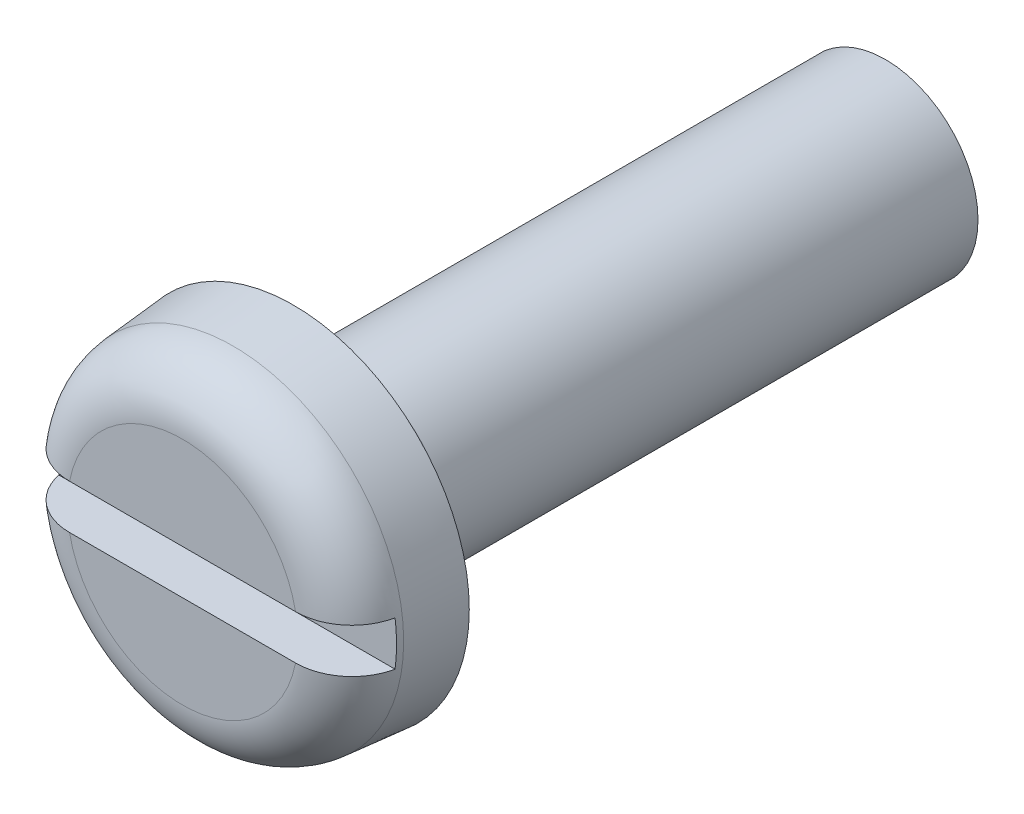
ISO-10303-21;
HEADER;
FILE_DESCRIPTION(('STEP AP214'),'2;1');
FILE_NAME('part.step','',(''),(''),'','','');
FILE_SCHEMA(('AUTOMOTIVE_DESIGN { 1 0 10303 214 1 1 1 1 }'));
ENDSEC;
DATA;
#1=APPLICATION_CONTEXT('core data for automotive mechanical design processes');
#2=APPLICATION_PROTOCOL_DEFINITION('international standard','automotive_design',2000,#1);
#3=PRODUCT_CONTEXT('',#1,'mechanical');
#4=PRODUCT('Part','Part','',(#3));
#5=PRODUCT_RELATED_PRODUCT_CATEGORY('part','',(#4));
#6=PRODUCT_DEFINITION_FORMATION('','',#4);
#7=PRODUCT_DEFINITION_CONTEXT('part definition',#1,'design');
#8=PRODUCT_DEFINITION('design','',#6,#7);
#9=PRODUCT_DEFINITION_SHAPE('','',#8);
#10=(LENGTH_UNIT() NAMED_UNIT(*) SI_UNIT(.MILLI.,.METRE.));
#11=(NAMED_UNIT(*) PLANE_ANGLE_UNIT() SI_UNIT($,.RADIAN.));
#12=(NAMED_UNIT(*) SI_UNIT($,.STERADIAN.) SOLID_ANGLE_UNIT());
#13=UNCERTAINTY_MEASURE_WITH_UNIT(LENGTH_MEASURE(1.E-05),#10,'distance_accuracy_value','');
#14=(GEOMETRIC_REPRESENTATION_CONTEXT(3) GLOBAL_UNCERTAINTY_ASSIGNED_CONTEXT((#13)) GLOBAL_UNIT_ASSIGNED_CONTEXT((#10,
#11,#12)) REPRESENTATION_CONTEXT('',''));
#15=CARTESIAN_POINT('',(0.,0.,0.));
#16=DIRECTION('',(0.,0.,1.));
#17=DIRECTION('',(1.,0.,0.));
#18=AXIS2_PLACEMENT_3D('',#15,#16,#17);
#19=CARTESIAN_POINT('',(0.,0.,-0.2));
#20=DIRECTION('',(0.,0.,1.));
#21=DIRECTION('',(1.,0.,0.));
#22=AXIS2_PLACEMENT_3D('',#19,#20,#21);
#23=TOROIDAL_SURFACE('',#22,2.5,0.2);
#24=CARTESIAN_POINT('',(0.,0.,0.));
#25=DIRECTION('',(0.,0.,1.));
#26=DIRECTION('',(1.,0.,0.));
#27=AXIS2_PLACEMENT_3D('',#24,#25,#26);
#28=CIRCLE('',#27,2.5);
#29=CARTESIAN_POINT('',(2.5,0.,0.));
#30=VERTEX_POINT('',#29);
#31=EDGE_CURVE('E117',#30,#30,#28,.T.);
#32=ORIENTED_EDGE('',*,*,#31,.F.);
#33=EDGE_LOOP('',(#32));
#34=FACE_BOUND('',#33,.T.);
#35=CARTESIAN_POINT('',(0.,0.,-0.228571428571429));
#36=DIRECTION('',(0.,0.,1.));
#37=DIRECTION('',(1.,0.,0.));
#38=AXIS2_PLACEMENT_3D('',#35,#36,#37);
#39=CIRCLE('',#38,2.30205133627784);
#40=CARTESIAN_POINT('',(2.30205133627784,0.,-0.228571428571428));
#41=VERTEX_POINT('',#40);
#42=EDGE_CURVE('E11',#41,#41,#39,.T.);
#43=ORIENTED_EDGE('',*,*,#42,.T.);
#44=EDGE_LOOP('',(#43));
#45=FACE_BOUND('',#44,.T.);
#46=ADVANCED_FACE('F34',(#34,#45),#23,.F.);
#47=CARTESIAN_POINT('',(0.,0.,-1.6));
#48=DIRECTION('',(0.,0.,-1.));
#49=DIRECTION('',(-1.,0.,0.));
#50=AXIS2_PLACEMENT_3D('',#47,#48,#49);
#51=CONICAL_SURFACE('',#50,2.5,0.143347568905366);
#52=ORIENTED_EDGE('',*,*,#42,.F.);
#53=EDGE_LOOP('',(#52));
#54=FACE_BOUND('',#53,.T.);
#55=CARTESIAN_POINT('',(0.,0.,-1.6));
#56=DIRECTION('',(0.,0.,1.));
#57=DIRECTION('',(1.,0.,0.));
#58=AXIS2_PLACEMENT_3D('',#55,#56,#57);
#59=CIRCLE('',#58,2.5);
#60=CARTESIAN_POINT('',(2.5,0.,-1.6));
#61=VERTEX_POINT('',#60);
#62=EDGE_CURVE('E42',#61,#61,#59,.T.);
#63=ORIENTED_EDGE('',*,*,#62,.T.);
#64=EDGE_LOOP('',(#63));
#65=FACE_BOUND('',#64,.T.);
#66=ADVANCED_FACE('F170',(#54,#65),#51,.T.);
#67=CARTESIAN_POINT('',(0.,0.,0.));
#68=DIRECTION('',(0.,0.,1.));
#69=DIRECTION('',(1.,0.,0.));
#70=AXIS2_PLACEMENT_3D('',#67,#68,#69);
#71=CYLINDRICAL_SURFACE('',#70,2.5);
#72=ORIENTED_EDGE('',*,*,#62,.F.);
#73=EDGE_LOOP('',(#72));
#74=FACE_BOUND('',#73,.T.);
#75=CARTESIAN_POINT('',(0.,0.,-16.));
#76=DIRECTION('',(0.,0.,-1.));
#77=DIRECTION('',(-1.,0.,0.));
#78=AXIS2_PLACEMENT_3D('',#75,#76,#77);
#79=CIRCLE('',#78,2.5);
#80=CARTESIAN_POINT('',(-2.5,0.,-16.));
#81=VERTEX_POINT('',#80);
#82=EDGE_CURVE('E161',#81,#81,#79,.T.);
#83=ORIENTED_EDGE('',*,*,#82,.F.);
#84=EDGE_LOOP('',(#83));
#85=FACE_BOUND('',#84,.T.);
#86=ADVANCED_FACE('F167',(#74,#85),#71,.T.);
#87=CARTESIAN_POINT('',(0.,-4.75,0.));
#88=DIRECTION('',(0.,0.,-1.));
#89=DIRECTION('',(-1.,0.,0.));
#90=AXIS2_PLACEMENT_3D('',#87,#88,#89);
#91=PLANE('',#90);
#92=CARTESIAN_POINT('',(0.,0.,0.));
#93=DIRECTION('',(0.,0.,1.));
#94=DIRECTION('',(1.,0.,0.));
#95=AXIS2_PLACEMENT_3D('',#92,#93,#94);
#96=CIRCLE('',#95,4.75);
#97=CARTESIAN_POINT('',(4.75,0.,0.));
#98=VERTEX_POINT('',#97);
#99=EDGE_CURVE('E144',#98,#98,#96,.T.);
#100=ORIENTED_EDGE('',*,*,#99,.F.);
#101=EDGE_LOOP('',(#100));
#102=FACE_BOUND('',#101,.T.);
#103=ORIENTED_EDGE('',*,*,#31,.T.);
#104=EDGE_LOOP('',(#103));
#105=FACE_BOUND('',#104,.T.);
#106=ADVANCED_FACE('F169',(#102,#105),#91,.T.);
#107=CARTESIAN_POINT('',(0.,-3.11303724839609,3.));
#108=DIRECTION('',(0.,0.,-1.));
#109=DIRECTION('',(-1.,0.,0.));
#110=AXIS2_PLACEMENT_3D('',#107,#108,#109);
#111=PLANE('',#110);
#112=CARTESIAN_POINT('',(0.,0.,3.));
#113=DIRECTION('',(0.,0.,1.));
#114=DIRECTION('',(1.,0.,0.));
#115=AXIS2_PLACEMENT_3D('',#112,#113,#114);
#116=CIRCLE('',#115,3.11303724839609);
#117=CARTESIAN_POINT('',(-3.05466870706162,-0.6,3.));
#118=VERTEX_POINT('',#117);
#119=CARTESIAN_POINT('',(3.05466870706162,-0.6,3.));
#120=VERTEX_POINT('',#119);
#121=EDGE_CURVE('E150',#118,#120,#116,.T.);
#122=ORIENTED_EDGE('',*,*,#121,.T.);
#123=DIRECTION('',(1.,0.,0.));
#124=VECTOR('',#123,1.);
#125=CARTESIAN_POINT('',(-4.75,-0.6,3.));
#126=LINE('',#125,#124);
#127=EDGE_CURVE('E65',#118,#120,#126,.T.);
#128=ORIENTED_EDGE('',*,*,#127,.F.);
#129=EDGE_LOOP('',(#122,#128));
#130=FACE_BOUND('',#129,.T.);
#131=ADVANCED_FACE('F177',(#130),#111,.F.);
#132=CARTESIAN_POINT('',(0.,0.,0.));
#133=DIRECTION('',(0.,0.,-1.));
#134=DIRECTION('',(-1.,0.,0.));
#135=AXIS2_PLACEMENT_3D('',#132,#133,#134);
#136=CONICAL_SURFACE('',#135,4.75,0.0872664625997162);
#137=CARTESIAN_POINT('',(0.,0.,1.63073361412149));
#138=DIRECTION('',(0.,0.,1.));
#139=DIRECTION('',(1.,0.,0.));
#140=AXIS2_PLACEMENT_3D('',#137,#138,#139);
#141=CIRCLE('',#140,4.60732929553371);
#142=CARTESIAN_POINT('',(4.60732929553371,0.,1.63073361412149));
#143=VERTEX_POINT('',#142);
#144=EDGE_CURVE('E151',#143,#143,#141,.T.);
#145=ORIENTED_EDGE('',*,*,#144,.F.);
#146=EDGE_LOOP('',(#145));
#147=FACE_BOUND('',#146,.T.);
#148=ORIENTED_EDGE('',*,*,#99,.T.);
#149=EDGE_LOOP('',(#148));
#150=FACE_BOUND('',#149,.T.);
#151=ADVANCED_FACE('F225',(#147,#150),#136,.T.);
#152=CARTESIAN_POINT('',(3.05466870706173,0.6,3.));
#153=VERTEX_POINT('',#152);
#154=CARTESIAN_POINT('',(-3.05466870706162,0.6,3.));
#155=VERTEX_POINT('',#154);
#156=EDGE_CURVE('E110',#153,#155,#116,.T.);
#157=ORIENTED_EDGE('',*,*,#156,.T.);
#158=DIRECTION('',(1.,0.,0.));
#159=VECTOR('',#158,1.);
#160=CARTESIAN_POINT('',(-4.75,0.6,3.));
#161=LINE('',#160,#159);
#162=EDGE_CURVE('E104',#155,#153,#161,.T.);
#163=ORIENTED_EDGE('',*,*,#162,.T.);
#164=EDGE_LOOP('',(#157,#163));
#165=FACE_BOUND('',#164,.T.);
#166=ADVANCED_FACE('F227',(#165),#111,.F.);
#167=CARTESIAN_POINT('',(0.,0.,1.5));
#168=DIRECTION('',(0.,0.,1.));
#169=DIRECTION('',(1.,0.,0.));
#170=AXIS2_PLACEMENT_3D('',#167,#168,#169);
#171=TOROIDAL_SURFACE('',#170,3.11303724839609,1.5);
#172=CARTESIAN_POINT('',(1.78444467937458,-0.6,2.35794138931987));
#173=CARTESIAN_POINT('',(1.83690352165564,-0.6,2.42924707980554));
#174=CARTESIAN_POINT('',(1.8955755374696,-0.6,2.49608392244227));
#175=CARTESIAN_POINT('',(2.02337981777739,-0.6,2.61902622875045));
#176=CARTESIAN_POINT('',(2.09253096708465,-0.6,2.67511189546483));
#177=CARTESIAN_POINT('',(2.23912059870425,-0.6,2.77492489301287));
#178=CARTESIAN_POINT('',(2.31654826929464,-0.6,2.81866808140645));
#179=CARTESIAN_POINT('',(2.47756798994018,-0.6,2.89264178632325));
#180=CARTESIAN_POINT('',(2.56115732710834,-0.6,2.92287820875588));
#181=CARTESIAN_POINT('',(2.73293900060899,-0.6,2.96912896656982));
#182=CARTESIAN_POINT('',(2.82116384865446,-0.6,2.98502287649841));
#183=CARTESIAN_POINT('',(2.99904386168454,-0.6,3.00155670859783));
#184=CARTESIAN_POINT('',(3.08869907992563,-0.6,3.00219606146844));
#185=CARTESIAN_POINT('',(3.26558059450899,-0.6,2.98814682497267));
#186=CARTESIAN_POINT('',(3.35282334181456,-0.6,2.97366589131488));
#187=CARTESIAN_POINT('',(3.52354291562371,-0.6,2.92998057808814));
#188=CARTESIAN_POINT('',(3.60702014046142,-0.6,2.90077775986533));
#189=CARTESIAN_POINT('',(3.76619303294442,-0.6,2.82907393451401));
#190=CARTESIAN_POINT('',(3.8420041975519,-0.6,2.78682927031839));
#191=CARTESIAN_POINT('',(3.98530836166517,-0.6,2.69002408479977));
#192=CARTESIAN_POINT('',(4.05280208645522,-0.6,2.63546463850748));
#193=CARTESIAN_POINT('',(4.17647632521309,-0.6,2.51649131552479));
#194=CARTESIAN_POINT('',(4.23281374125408,-0.6,2.45224049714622));
#195=CARTESIAN_POINT('',(4.33376627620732,-0.6,2.31510841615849));
#196=CARTESIAN_POINT('',(4.37838209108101,-0.6,2.24222766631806));
#197=CARTESIAN_POINT('',(4.4541578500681,-0.6,2.09072248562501));
#198=CARTESIAN_POINT('',(4.4854521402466,-0.6,2.01216522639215));
#199=CARTESIAN_POINT('',(4.53432193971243,-0.6,1.85089373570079));
#200=CARTESIAN_POINT('',(4.55189796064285,-0.6,1.7681796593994));
#201=CARTESIAN_POINT('',(4.57274942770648,-0.6,1.60145125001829));
#202=CARTESIAN_POINT('',(4.57610622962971,-0.6,1.51744708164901));
#203=CARTESIAN_POINT('',(4.56864397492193,-0.6,1.35007159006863));
#204=CARTESIAN_POINT('',(4.55782514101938,-0.6,1.26670025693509));
#205=CARTESIAN_POINT('',(4.52235909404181,-0.6,1.10309443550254));
#206=CARTESIAN_POINT('',(4.49773409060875,-0.6,1.02285512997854));
#207=CARTESIAN_POINT('',(4.43539277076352,-0.6,0.867636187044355));
#208=CARTESIAN_POINT('',(4.39767641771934,-0.6,0.79265656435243));
#209=CARTESIAN_POINT('',(4.31014761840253,-0.6,0.649886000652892));
#210=CARTESIAN_POINT('',(4.26030712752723,-0.6,0.58211225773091));
#211=CARTESIAN_POINT('',(4.15002218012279,-0.6,0.455828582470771));
#212=CARTESIAN_POINT('',(4.0895774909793,-0.6,0.397318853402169));
#213=CARTESIAN_POINT('',(3.95939810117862,-0.6,0.290802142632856));
#214=CARTESIAN_POINT('',(3.88960598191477,-0.6,0.242865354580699));
#215=CARTESIAN_POINT('',(3.7430351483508,-0.6,0.15924465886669));
#216=CARTESIAN_POINT('',(3.66625613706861,-0.6,0.123561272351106));
#217=CARTESIAN_POINT('',(3.5069992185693,-0.6,0.0650186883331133));
#218=CARTESIAN_POINT('',(3.42446799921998,-0.6,0.0423045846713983));
#219=CARTESIAN_POINT('',(3.25679047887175,-0.6,0.0108239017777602));
#220=CARTESIAN_POINT('',(3.17164399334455,-0.6,0.00205830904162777));
#221=CARTESIAN_POINT('',(2.99973325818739,-0.6,-0.00144063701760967));
#222=CARTESIAN_POINT('',(2.9129645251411,-0.6,0.00404749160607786));
#223=CARTESIAN_POINT('',(2.74151789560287,-0.6,0.0292395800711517));
#224=CARTESIAN_POINT('',(2.65684020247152,-0.6,0.0489449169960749));
#225=CARTESIAN_POINT('',(2.49032583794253,-0.6,0.10241437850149));
#226=CARTESIAN_POINT('',(2.40856994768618,-0.6,0.136430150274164));
#227=CARTESIAN_POINT('',(2.25181146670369,-0.6,0.217532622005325));
#228=CARTESIAN_POINT('',(2.17680984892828,-0.6,0.264621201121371));
#229=CARTESIAN_POINT('',(2.03476656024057,-0.6,0.371261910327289));
#230=CARTESIAN_POINT('',(1.9678365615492,-0.6,0.430962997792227));
#231=CARTESIAN_POINT('',(1.84509773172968,-0.6,0.560904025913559));
#232=CARTESIAN_POINT('',(1.78928972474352,-0.6,0.631144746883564));
#233=CARTESIAN_POINT('',(1.69151599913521,-0.6,0.779227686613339));
#234=CARTESIAN_POINT('',(1.64935982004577,-0.6,0.856943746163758));
#235=CARTESIAN_POINT('',(1.57962775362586,-0.6,1.01865372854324));
#236=CARTESIAN_POINT('',(1.55204276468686,-0.6,1.10264369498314));
#237=CARTESIAN_POINT('',(1.51405337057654,-0.6,1.26925299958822));
#238=CARTESIAN_POINT('',(1.50273689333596,-0.6,1.35166422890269));
#239=CARTESIAN_POINT('',(1.49493998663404,-0.6,1.51719840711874));
#240=CARTESIAN_POINT('',(1.49845862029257,-0.6,1.60032131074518));
#241=CARTESIAN_POINT('',(1.5195684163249,-0.6,1.76045042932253));
#242=CARTESIAN_POINT('',(1.53644040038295,-0.6,1.83755362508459));
#243=CARTESIAN_POINT('',(1.58254863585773,-0.6,1.98789309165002));
#244=CARTESIAN_POINT('',(1.61177190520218,-0.6,2.06113333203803));
#245=CARTESIAN_POINT('',(1.6661558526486,-0.6,2.17122521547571));
#246=CARTESIAN_POINT('',(1.68752043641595,-0.6,2.21000400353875));
#247=CARTESIAN_POINT('',(1.73355428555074,-0.6,2.28554106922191));
#248=CARTESIAN_POINT('',(1.75822331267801,-0.6,2.32229949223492));
#249=CARTESIAN_POINT('',(1.78444467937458,-0.6,2.35794138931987));
#250=B_SPLINE_CURVE_WITH_KNOTS('',3,(#172,#173,#174,#175,#176,#177,#178,#179,#180,#181,#182,
#183,#184,#185,#186,#187,#188,#189,#190,#191,#192,#193,#194,#195,#196,#197,#198,#199,#200,#201,
#202,#203,#204,#205,#206,#207,#208,#209,#210,#211,#212,#213,#214,#215,#216,#217,#218,#219,#220,
#221,#222,#223,#224,#225,#226,#227,#228,#229,#230,#231,#232,#233,#234,#235,#236,#237,#238,#239,
#240,#241,#242,#243,#244,#245,#246,#247,#248,#249),.UNSPECIFIED.,.T.,.F.,(4,2,2,2,2,2,2,2,2,2,2,
2,2,2,2,2,2,2,2,2,2,2,2,2,2,2,2,2,2,2,2,2,2,2,2,2,2,2,4),(0.,0.26540428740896,0.531292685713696,
0.796837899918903,1.06226688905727,1.329904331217,1.59755176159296,1.86157117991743,
2.12556260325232,2.3846640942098,2.64374297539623,2.89886888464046,3.15397964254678,
3.40645291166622,3.65891676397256,3.90993416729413,4.16094762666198,4.41155844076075,
4.66216995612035,4.9133667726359,5.16456910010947,5.41739205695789,5.67022576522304,
5.92583525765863,6.18146282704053,6.44108615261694,6.70073462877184,6.96515356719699,
7.22961053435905,7.49738541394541,7.76518012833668,8.02905935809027,8.29277356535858,
8.54103382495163,8.78927840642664,9.02499451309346,9.26046347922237,9.39313443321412,
9.52579582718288),.UNSPECIFIED.);
#251=CARTESIAN_POINT('',(4.54328342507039,-0.6,1.8));
#252=VERTEX_POINT('',#251);
#253=EDGE_CURVE('E112',#120,#252,#250,.T.);
#254=ORIENTED_EDGE('',*,*,#253,.F.);
#255=ORIENTED_EDGE('',*,*,#121,.F.);
#256=CARTESIAN_POINT('',(-4.16448807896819,-0.6,2.52575634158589));
#257=CARTESIAN_POINT('',(-4.10593108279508,-0.6,2.58759040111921));
#258=CARTESIAN_POINT('',(-4.04205754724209,-0.6,2.64448315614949));
#259=CARTESIAN_POINT('',(-3.90557965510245,-0.6,2.74673868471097));
#260=CARTESIAN_POINT('',(-3.8329636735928,-0.6,2.79208585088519));
#261=CARTESIAN_POINT('',(-3.6812385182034,-0.6,2.86993634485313));
#262=CARTESIAN_POINT('',(-3.60213624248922,-0.6,2.90245310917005));
#263=CARTESIAN_POINT('',(-3.43965944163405,-0.6,2.95388684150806));
#264=CARTESIAN_POINT('',(-3.35628600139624,-0.6,2.97280724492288));
#265=CARTESIAN_POINT('',(-3.18666752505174,-0.6,2.99679128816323));
#266=CARTESIAN_POINT('',(-3.10040138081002,-0.6,3.00170544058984));
#267=CARTESIAN_POINT('',(-2.92823768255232,-0.6,2.99724984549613));
#268=CARTESIAN_POINT('',(-2.84234017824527,-0.6,2.98787822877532));
#269=CARTESIAN_POINT('',(-2.67171740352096,-0.6,2.95493830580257));
#270=CARTESIAN_POINT('',(-2.58704058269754,-0.6,2.93111906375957));
#271=CARTESIAN_POINT('',(-2.4227747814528,-0.6,2.86983644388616));
#272=CARTESIAN_POINT('',(-2.34318639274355,-0.6,2.83237148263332));
#273=CARTESIAN_POINT('',(-2.19000637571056,-0.6,2.74414265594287));
#274=CARTESIAN_POINT('',(-2.11653425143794,-0.6,2.69317111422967));
#275=CARTESIAN_POINT('',(-1.97917572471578,-0.6,2.57960096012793));
#276=CARTESIAN_POINT('',(-1.9152908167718,-0.6,2.51700053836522));
#277=CARTESIAN_POINT('',(-1.79922493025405,-0.6,2.38190312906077));
#278=CARTESIAN_POINT('',(-1.74702578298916,-0.6,2.30942179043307));
#279=CARTESIAN_POINT('',(-1.65617143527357,-0.6,2.15640604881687));
#280=CARTESIAN_POINT('',(-1.61751169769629,-0.6,2.07587435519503));
#281=CARTESIAN_POINT('',(-1.55688948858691,-0.6,1.91273839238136));
#282=CARTESIAN_POINT('',(-1.53427068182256,-0.6,1.83037882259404));
#283=CARTESIAN_POINT('',(-1.50426955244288,-0.6,1.66294547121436));
#284=CARTESIAN_POINT('',(-1.49687837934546,-0.6,1.57787329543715));
#285=CARTESIAN_POINT('',(-1.4977182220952,-0.6,1.41331484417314));
#286=CARTESIAN_POINT('',(-1.50497326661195,-0.6,1.33382186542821));
#287=CARTESIAN_POINT('',(-1.53279061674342,-0.6,1.17720481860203));
#288=CARTESIAN_POINT('',(-1.55335401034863,-0.6,1.10008094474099));
#289=CARTESIAN_POINT('',(-1.60674103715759,-0.6,0.950510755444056));
#290=CARTESIAN_POINT('',(-1.63952477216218,-0.6,0.878050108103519));
#291=CARTESIAN_POINT('',(-1.7161028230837,-0.6,0.739209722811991));
#292=CARTESIAN_POINT('',(-1.75989979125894,-0.6,0.672831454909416));
#293=CARTESIAN_POINT('',(-1.86010993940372,-0.6,0.54375216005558));
#294=CARTESIAN_POINT('',(-1.91712921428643,-0.6,0.48152158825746));
#295=CARTESIAN_POINT('',(-2.04035161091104,-0.6,0.366934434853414));
#296=CARTESIAN_POINT('',(-2.10655695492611,-0.6,0.314580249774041));
#297=CARTESIAN_POINT('',(-2.24995520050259,-0.6,0.218621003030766));
#298=CARTESIAN_POINT('',(-2.32753422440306,-0.6,0.175591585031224));
#299=CARTESIAN_POINT('',(-2.48876491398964,-0.6,0.103010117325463));
#300=CARTESIAN_POINT('',(-2.57241708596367,-0.6,0.0734591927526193));
#301=CARTESIAN_POINT('',(-2.74436421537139,-0.6,0.0285216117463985));
#302=CARTESIAN_POINT('',(-2.83269773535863,-0.6,0.0132820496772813));
#303=CARTESIAN_POINT('',(-3.0106737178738,-0.6,-0.00192802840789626));
#304=CARTESIAN_POINT('',(-3.10031610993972,-0.6,-0.00189936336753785));
#305=CARTESIAN_POINT('',(-3.27703669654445,-0.6,0.0134667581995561));
#306=CARTESIAN_POINT('',(-3.36413320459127,-0.6,0.0285931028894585));
#307=CARTESIAN_POINT('',(-3.53445278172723,-0.6,0.0735345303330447));
#308=CARTESIAN_POINT('',(-3.61767622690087,-0.6,0.103348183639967));
#309=CARTESIAN_POINT('',(-3.7762470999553,-0.6,0.176209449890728));
#310=CARTESIAN_POINT('',(-3.8517117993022,-0.6,0.219001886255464));
#311=CARTESIAN_POINT('',(-3.99423591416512,-0.6,0.316834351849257));
#312=CARTESIAN_POINT('',(-4.06129603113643,-0.6,0.371873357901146));
#313=CARTESIAN_POINT('',(-4.18404243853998,-0.6,0.491722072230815));
#314=CARTESIAN_POINT('',(-4.23988572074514,-0.6,0.556371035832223));
#315=CARTESIAN_POINT('',(-4.33979100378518,-0.6,0.694208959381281));
#316=CARTESIAN_POINT('',(-4.38385368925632,-0.6,0.767397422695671));
#317=CARTESIAN_POINT('',(-4.45849174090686,-0.6,0.919425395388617));
#318=CARTESIAN_POINT('',(-4.48920025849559,-0.6,0.998199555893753));
#319=CARTESIAN_POINT('',(-4.53687031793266,-0.6,1.159799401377));
#320=CARTESIAN_POINT('',(-4.55383292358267,-0.6,1.24262477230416));
#321=CARTESIAN_POINT('',(-4.57345374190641,-0.6,1.40946823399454));
#322=CARTESIAN_POINT('',(-4.5761935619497,-0.6,1.49347674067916));
#323=CARTESIAN_POINT('',(-4.56750581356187,-0.6,1.66078113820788));
#324=CARTESIAN_POINT('',(-4.55607478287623,-0.6,1.74407684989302));
#325=CARTESIAN_POINT('',(-4.51940184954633,-0.6,1.90747064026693));
#326=CARTESIAN_POINT('',(-4.49417405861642,-0.6,1.98757189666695));
#327=CARTESIAN_POINT('',(-4.43067007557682,-0.6,2.14234114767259));
#328=CARTESIAN_POINT('',(-4.39241024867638,-0.6,2.21701581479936));
#329=CARTESIAN_POINT('',(-4.32168602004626,-0.6,2.33052120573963));
#330=CARTESIAN_POINT('',(-4.29300657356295,-0.6,2.37175930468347));
#331=CARTESIAN_POINT('',(-4.23166298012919,-0.6,2.45115580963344));
#332=CARTESIAN_POINT('',(-4.1989988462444,-0.6,2.48931422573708));
#333=CARTESIAN_POINT('',(-4.16448807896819,-0.6,2.52575634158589));
#334=B_SPLINE_CURVE_WITH_KNOTS('',3,(#256,#257,#258,#259,#260,#261,#262,#263,#264,#265,#266,
#267,#268,#269,#270,#271,#272,#273,#274,#275,#276,#277,#278,#279,#280,#281,#282,#283,#284,#285,
#286,#287,#288,#289,#290,#291,#292,#293,#294,#295,#296,#297,#298,#299,#300,#301,#302,#303,#304,
#305,#306,#307,#308,#309,#310,#311,#312,#313,#314,#315,#316,#317,#318,#319,#320,#321,#322,#323,
#324,#325,#326,#327,#328,#329,#330,#331,#332,#333),.UNSPECIFIED.,.T.,.F.,(4,2,2,2,2,2,2,2,2,2,2,
2,2,2,2,2,2,2,2,2,2,2,2,2,2,2,2,2,2,2,2,2,2,2,2,2,2,2,4),(0.,0.255296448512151,
0.510936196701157,0.76630751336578,1.02161428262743,1.27963589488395,1.5376912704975,
1.8003624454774,2.06306411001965,2.33006648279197,2.59711043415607,2.8637362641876,
3.13027266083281,3.38515155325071,3.63988226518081,3.87819866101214,4.11653454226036,
4.35409900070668,4.59172072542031,4.84382021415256,5.09598079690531,5.36088081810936,
5.62580294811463,5.89341910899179,6.16102091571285,6.42493252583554,6.68881845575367,
6.94781983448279,7.20679958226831,7.46185384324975,7.71689327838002,7.96932796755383,
8.22174311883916,8.47270835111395,8.72373491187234,8.97450519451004,9.22496172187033,
9.37542205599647,9.52588189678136),.UNSPECIFIED.);
#335=CARTESIAN_POINT('',(-4.54328342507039,-0.6,1.8));
#336=VERTEX_POINT('',#335);
#337=EDGE_CURVE('E94',#336,#118,#334,.T.);
#338=ORIENTED_EDGE('',*,*,#337,.F.);
#339=CARTESIAN_POINT('',(0.,0.,1.8));
#340=DIRECTION('',(0.,0.,-1.));
#341=DIRECTION('',(-1.,0.,0.));
#342=AXIS2_PLACEMENT_3D('',#339,#340,#341);
#343=CIRCLE('',#342,4.582731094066);
#344=CARTESIAN_POINT('',(-4.54328342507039,0.6,1.8));
#345=VERTEX_POINT('',#344);
#346=EDGE_CURVE('E96',#345,#336,#343,.F.);
#347=ORIENTED_EDGE('',*,*,#346,.F.);
#348=CARTESIAN_POINT('',(-4.16448807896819,0.6,2.52575634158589));
#349=CARTESIAN_POINT('',(-4.2222007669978,0.6,2.46480270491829));
#350=CARTESIAN_POINT('',(-4.27483380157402,0.6,2.3989590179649));
#351=CARTESIAN_POINT('',(-4.36835495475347,0.6,2.25932438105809));
#352=CARTESIAN_POINT('',(-4.40922990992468,0.6,2.18552465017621));
#353=CARTESIAN_POINT('',(-4.47797693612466,0.6,2.0321094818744));
#354=CARTESIAN_POINT('',(-4.50585200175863,0.6,1.95249538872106));
#355=CARTESIAN_POINT('',(-4.54777716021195,0.6,1.78972713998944));
#356=CARTESIAN_POINT('',(-4.56183052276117,0.6,1.70657382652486));
#357=CARTESIAN_POINT('',(-4.57568541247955,0.6,1.53938213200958));
#358=CARTESIAN_POINT('',(-4.57553672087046,0.6,1.45534787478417));
#359=CARTESIAN_POINT('',(-4.56111544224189,0.6,1.28849842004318));
#360=CARTESIAN_POINT('',(-4.54684255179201,0.6,1.20568324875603));
#361=CARTESIAN_POINT('',(-4.5046163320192,0.6,1.04371892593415));
#362=CARTESIAN_POINT('',(-4.47667847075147,0.6,0.964565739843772));
#363=CARTESIAN_POINT('',(-4.40794662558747,0.6,0.812055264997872));
#364=CARTESIAN_POINT('',(-4.3671525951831,0.6,0.738697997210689));
#365=CARTESIAN_POINT('',(-4.27376142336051,0.6,0.599626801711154));
#366=CARTESIAN_POINT('',(-4.2211312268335,0.6,0.533935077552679));
#367=CARTESIAN_POINT('',(-4.10565865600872,0.6,0.412245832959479));
#368=CARTESIAN_POINT('',(-4.04281605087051,0.6,0.356248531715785));
#369=CARTESIAN_POINT('',(-3.90824759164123,0.6,0.255100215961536));
#370=CARTESIAN_POINT('',(-3.83646274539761,0.6,0.210027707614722));
#371=CARTESIAN_POINT('',(-3.68641296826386,0.6,0.132418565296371));
#372=CARTESIAN_POINT('',(-3.60814773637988,0.6,0.0998825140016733));
#373=CARTESIAN_POINT('',(-3.44640006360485,0.6,0.0478448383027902));
#374=CARTESIAN_POINT('',(-3.36286776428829,0.6,0.0284982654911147));
#375=CARTESIAN_POINT('',(-3.19375865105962,0.6,0.00386379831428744));
#376=CARTESIAN_POINT('',(-3.10818168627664,0.6,-0.00142305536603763));
#377=CARTESIAN_POINT('',(-2.93593785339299,0.6,0.00210511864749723));
#378=CARTESIAN_POINT('',(-2.84927570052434,0.6,0.0111492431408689));
#379=CARTESIAN_POINT('',(-2.67862588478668,0.6,0.0433870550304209));
#380=CARTESIAN_POINT('',(-2.59463849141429,0.6,0.066582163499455));
#381=CARTESIAN_POINT('',(-2.43009011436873,0.6,0.126940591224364));
#382=CARTESIAN_POINT('',(-2.34962013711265,0.6,0.164352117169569));
#383=CARTESIAN_POINT('',(-2.19599172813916,0.6,0.252010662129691));
#384=CARTESIAN_POINT('',(-2.12283440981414,0.6,0.302259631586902));
#385=CARTESIAN_POINT('',(-1.98517825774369,0.6,0.414847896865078));
#386=CARTESIAN_POINT('',(-1.9207797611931,0.6,0.477310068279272));
#387=CARTESIAN_POINT('',(-1.80360821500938,0.6,0.612352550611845));
#388=CARTESIAN_POINT('',(-1.75083532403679,0.6,0.68493299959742));
#389=CARTESIAN_POINT('',(-1.65981326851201,0.6,0.836758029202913));
#390=CARTESIAN_POINT('',(-1.62129637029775,0.6,0.915841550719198));
#391=CARTESIAN_POINT('',(-1.55909823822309,0.6,1.07963318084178));
#392=CARTESIAN_POINT('',(-1.53540769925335,0.6,1.16433772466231));
#393=CARTESIAN_POINT('',(-1.50512561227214,0.6,1.33131492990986));
#394=CARTESIAN_POINT('',(-1.4975631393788,0.6,1.41341170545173));
#395=CARTESIAN_POINT('',(-1.49703912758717,0.6,1.57764133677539));
#396=CARTESIAN_POINT('',(-1.50407401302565,0.6,1.65977417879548));
#397=CARTESIAN_POINT('',(-1.53172166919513,0.6,1.81799943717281));
#398=CARTESIAN_POINT('',(-1.55172937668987,0.6,1.89419910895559));
#399=CARTESIAN_POINT('',(-1.60381093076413,0.6,2.04235033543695));
#400=CARTESIAN_POINT('',(-1.63588728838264,0.6,2.11430100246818));
#401=CARTESIAN_POINT('',(-1.71223681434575,0.6,2.25475429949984));
#402=CARTESIAN_POINT('',(-1.75690511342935,0.6,2.3230416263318));
#403=CARTESIAN_POINT('',(-1.85641398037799,0.6,2.45174681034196));
#404=CARTESIAN_POINT('',(-1.91125716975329,0.6,2.51216263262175));
#405=CARTESIAN_POINT('',(-2.03339957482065,0.6,2.62739536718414));
#406=CARTESIAN_POINT('',(-2.10127142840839,0.6,2.68160626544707));
#407=CARTESIAN_POINT('',(-2.24492747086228,0.6,2.77827829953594));
#408=CARTESIAN_POINT('',(-2.32071308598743,0.6,2.82073731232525));
#409=CARTESIAN_POINT('',(-2.48060945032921,0.6,2.89387356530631));
#410=CARTESIAN_POINT('',(-2.56490423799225,0.6,2.92414954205));
#411=CARTESIAN_POINT('',(-2.73739364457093,0.6,2.97005194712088));
#412=CARTESIAN_POINT('',(-2.82558812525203,0.6,2.98567889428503));
#413=CARTESIAN_POINT('',(-3.00295249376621,0.6,3.00166405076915));
#414=CARTESIAN_POINT('',(-3.0921161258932,0.6,3.00209133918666));
#415=CARTESIAN_POINT('',(-3.26923006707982,0.6,2.98768467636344));
#416=CARTESIAN_POINT('',(-3.35718016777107,0.6,2.97284813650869));
#417=CARTESIAN_POINT('',(-3.52770551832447,0.6,2.92860575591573));
#418=CARTESIAN_POINT('',(-3.61034739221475,0.6,2.89945615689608));
#419=CARTESIAN_POINT('',(-3.76935382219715,0.6,2.82746738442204));
#420=CARTESIAN_POINT('',(-3.84572657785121,0.6,2.78464646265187));
#421=CARTESIAN_POINT('',(-3.96252994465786,0.6,2.70518941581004));
#422=CARTESIAN_POINT('',(-4.00560511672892,0.6,2.67236876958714));
#423=CARTESIAN_POINT('',(-4.08798619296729,0.6,2.60229457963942));
#424=CARTESIAN_POINT('',(-4.12729213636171,0.6,2.56504108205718));
#425=CARTESIAN_POINT('',(-4.16448807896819,0.6,2.52575634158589));
#426=B_SPLINE_CURVE_WITH_KNOTS('',3,(#348,#349,#350,#351,#352,#353,#354,#355,#356,#357,#358,
#359,#360,#361,#362,#363,#364,#365,#366,#367,#368,#369,#370,#371,#372,#373,#374,#375,#376,#377,
#378,#379,#380,#381,#382,#383,#384,#385,#386,#387,#388,#389,#390,#391,#392,#393,#394,#395,#396,
#397,#398,#399,#400,#401,#402,#403,#404,#405,#406,#407,#408,#409,#410,#411,#412,#413,#414,#415,
#416,#417,#418,#419,#420,#421,#422,#423,#424,#425),.UNSPECIFIED.,.T.,.F.,(4,2,2,2,2,2,2,2,2,2,2,
2,2,2,2,2,2,2,2,2,2,2,2,2,2,2,2,2,2,2,2,2,2,2,2,2,2,2,4),(0.,0.251627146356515,
0.503534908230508,0.755384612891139,1.00717472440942,1.25808229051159,1.50899524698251,
1.7596248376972,2.01025533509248,2.26159466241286,2.51293967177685,2.76604060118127,
3.01915329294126,3.27519243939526,3.53125053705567,3.79144347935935,4.05166255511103,
4.31665070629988,4.5816791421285,4.84952563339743,5.11737577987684,5.37990411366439,
5.64226751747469,5.88833003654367,6.13433228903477,6.36961414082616,6.60494497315,
6.84869102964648,7.09249997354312,7.35191672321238,7.61138030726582,7.87880123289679,
8.14621268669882,8.41240865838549,8.67864978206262,8.94028930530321,9.20158098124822,
9.36375686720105,9.52593106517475),.UNSPECIFIED.);
#427=EDGE_CURVE('E101',#155,#345,#426,.T.);
#428=ORIENTED_EDGE('',*,*,#427,.F.);
#429=ORIENTED_EDGE('',*,*,#156,.F.);
#430=CARTESIAN_POINT('',(1.78444467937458,0.6,2.35794138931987));
#431=CARTESIAN_POINT('',(1.73578880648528,0.6,2.29179696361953));
#432=CARTESIAN_POINT('',(1.69241067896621,0.6,2.22172063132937));
#433=CARTESIAN_POINT('',(1.61775076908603,0.6,2.07533867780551));
#434=CARTESIAN_POINT('',(1.5864751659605,0.6,1.99902989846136));
#435=CARTESIAN_POINT('',(1.53733532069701,0.6,1.84198248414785));
#436=CARTESIAN_POINT('',(1.51950238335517,0.6,1.76123397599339));
#437=CARTESIAN_POINT('',(1.49831173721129,0.6,1.59787800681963));
#438=CARTESIAN_POINT('',(1.49494759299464,0.6,1.51527138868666));
#439=CARTESIAN_POINT('',(1.50270631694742,0.6,1.35404016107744));
#440=CARTESIAN_POINT('',(1.51326068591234,0.6,1.27538742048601));
#441=CARTESIAN_POINT('',(1.54733501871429,0.6,1.12094605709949));
#442=CARTESIAN_POINT('',(1.57085729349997,0.6,1.04515794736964));
#443=CARTESIAN_POINT('',(1.63005609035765,0.6,0.897825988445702));
#444=CARTESIAN_POINT('',(1.66582579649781,0.6,0.826319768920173));
#445=CARTESIAN_POINT('',(1.74815983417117,0.6,0.689827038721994));
#446=CARTESIAN_POINT('',(1.79472677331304,0.6,0.624842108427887));
#447=CARTESIAN_POINT('',(1.90052230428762,0.6,0.498889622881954));
#448=CARTESIAN_POINT('',(1.96036731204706,0.6,0.438439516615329));
#449=CARTESIAN_POINT('',(2.08896077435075,0.6,0.327892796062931));
#450=CARTESIAN_POINT('',(2.1577112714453,0.6,0.277798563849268));
#451=CARTESIAN_POINT('',(2.30563751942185,0.6,0.187152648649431));
#452=CARTESIAN_POINT('',(2.3851467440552,0.6,0.147143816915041));
#453=CARTESIAN_POINT('',(2.54972911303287,0.6,0.0809456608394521));
#454=CARTESIAN_POINT('',(2.63480260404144,0.6,0.0547571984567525));
#455=CARTESIAN_POINT('',(2.80866920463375,0.6,0.0169288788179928));
#456=CARTESIAN_POINT('',(2.8974815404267,0.6,0.00537709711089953));
#457=CARTESIAN_POINT('',(3.07577878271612,0.6,-0.00240662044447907));
#458=CARTESIAN_POINT('',(3.16526364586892,0.6,0.00136046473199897));
#459=CARTESIAN_POINT('',(3.34090743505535,0.6,0.02407566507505));
#460=CARTESIAN_POINT('',(3.42709622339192,0.6,0.0427925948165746));
#461=CARTESIAN_POINT('',(3.59499998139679,0.6,0.0947043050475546));
#462=CARTESIAN_POINT('',(3.67671538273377,0.6,0.127897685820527));
#463=CARTESIAN_POINT('',(3.83175947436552,0.6,0.207148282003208));
#464=CARTESIAN_POINT('',(3.90521449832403,0.6,0.252958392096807));
#465=CARTESIAN_POINT('',(4.04323981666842,0.6,0.356432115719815));
#466=CARTESIAN_POINT('',(4.10781084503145,0.6,0.414094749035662));
#467=CARTESIAN_POINT('',(4.22525214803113,0.6,0.53871672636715));
#468=CARTESIAN_POINT('',(4.27827922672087,0.6,0.605528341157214));
#469=CARTESIAN_POINT('',(4.37223374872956,0.6,0.747177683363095));
#470=CARTESIAN_POINT('',(4.41316188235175,0.6,0.822014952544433));
#471=CARTESIAN_POINT('',(4.4813608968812,0.6,0.976808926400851));
#472=CARTESIAN_POINT('',(4.50875968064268,0.6,1.05670929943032));
#473=CARTESIAN_POINT('',(4.54967680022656,0.6,1.21998817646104));
#474=CARTESIAN_POINT('',(4.5631956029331,0.6,1.30336656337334));
#475=CARTESIAN_POINT('',(4.57591948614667,0.6,1.47077798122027));
#476=CARTESIAN_POINT('',(4.57519739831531,0.6,1.55480548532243));
#477=CARTESIAN_POINT('',(4.55963992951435,0.6,1.72154271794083));
#478=CARTESIAN_POINT('',(4.54480472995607,0.6,1.80425246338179));
#479=CARTESIAN_POINT('',(4.50147996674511,0.6,1.96592130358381));
#480=CARTESIAN_POINT('',(4.47300456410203,0.6,2.04488419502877));
#481=CARTESIAN_POINT('',(4.40323812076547,0.6,2.19692744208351));
#482=CARTESIAN_POINT('',(4.36194701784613,0.6,2.27000776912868));
#483=CARTESIAN_POINT('',(4.26761123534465,0.6,2.40845167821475));
#484=CARTESIAN_POINT('',(4.21453273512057,0.6,2.4737922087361));
#485=CARTESIAN_POINT('',(4.09822911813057,0.6,2.59471038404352));
#486=CARTESIAN_POINT('',(4.03500374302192,0.6,2.65028778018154));
#487=CARTESIAN_POINT('',(3.8997375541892,0.6,2.75054138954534));
#488=CARTESIAN_POINT('',(3.82763756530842,0.6,2.79513773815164));
#489=CARTESIAN_POINT('',(3.67704118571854,0.6,2.87175033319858));
#490=CARTESIAN_POINT('',(3.59854447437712,0.6,2.90376594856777));
#491=CARTESIAN_POINT('',(3.4364118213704,0.6,2.95473043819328));
#492=CARTESIAN_POINT('',(3.35272657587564,0.6,2.97352238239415));
#493=CARTESIAN_POINT('',(3.18340853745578,0.6,2.99703038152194));
#494=CARTESIAN_POINT('',(3.09777567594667,0.6,3.00174593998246));
#495=CARTESIAN_POINT('',(2.92551527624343,0.6,2.99706659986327));
#496=CARTESIAN_POINT('',(2.8388939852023,0.6,2.98744277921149));
#497=CARTESIAN_POINT('',(2.66839997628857,0.6,2.95405651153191));
#498=CARTESIAN_POINT('',(2.58452815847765,0.6,2.93028948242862));
#499=CARTESIAN_POINT('',(2.4202802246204,0.6,2.86879366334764));
#500=CARTESIAN_POINT('',(2.33999891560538,0.6,2.83081188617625));
#501=CARTESIAN_POINT('',(2.18690708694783,0.6,2.742067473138));
#502=CARTESIAN_POINT('',(2.11409010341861,0.6,2.69131602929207));
#503=CARTESIAN_POINT('',(1.99703450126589,0.6,2.59424353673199));
#504=CARTESIAN_POINT('',(1.95050063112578,0.6,2.55065663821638));
#505=CARTESIAN_POINT('',(1.86306846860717,0.6,2.45814819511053));
#506=CARTESIAN_POINT('',(1.82217015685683,0.6,2.40922666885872));
#507=CARTESIAN_POINT('',(1.78444467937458,0.6,2.35794138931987));
#508=B_SPLINE_CURVE_WITH_KNOTS('',3,(#430,#431,#432,#433,#434,#435,#436,#437,#438,#439,#440,
#441,#442,#443,#444,#445,#446,#447,#448,#449,#450,#451,#452,#453,#454,#455,#456,#457,#458,#459,
#460,#461,#462,#463,#464,#465,#466,#467,#468,#469,#470,#471,#472,#473,#474,#475,#476,#477,#478,
#479,#480,#481,#482,#483,#484,#485,#486,#487,#488,#489,#490,#491,#492,#493,#494,#495,#496,#497,
#498,#499,#500,#501,#502,#503,#504,#505,#506,#507),.UNSPECIFIED.,.T.,.F.,(4,2,2,2,2,2,2,2,2,2,2,
2,2,2,2,2,2,2,2,2,2,2,2,2,2,2,2,2,2,2,2,2,2,2,2,2,2,2,4),(0.,0.246126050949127,0.49237760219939,
0.739200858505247,0.985914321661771,1.22285638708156,1.4598406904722,1.6986696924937,
1.93755643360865,2.19161852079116,2.44573898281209,2.7115111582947,2.97729990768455,
3.24468054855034,3.51204410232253,3.77535136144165,4.0386331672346,4.29708605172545,
4.55551757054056,4.81018291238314,5.06483372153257,5.31702870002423,5.56921519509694,
5.82011227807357,6.07100613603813,6.32164008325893,6.57227524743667,6.82363905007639,
7.07500925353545,7.32815697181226,7.58131738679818,7.83743366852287,8.09355898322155,
8.35381727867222,8.61415993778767,8.87937525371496,9.14435892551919,9.33519415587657,
9.5260287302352),.UNSPECIFIED.);
#509=CARTESIAN_POINT('',(4.54328342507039,0.6,1.8));
#510=VERTEX_POINT('',#509);
#511=EDGE_CURVE('E93',#510,#153,#508,.T.);
#512=ORIENTED_EDGE('',*,*,#511,.F.);
#513=EDGE_CURVE('E86',#252,#510,#343,.F.);
#514=ORIENTED_EDGE('',*,*,#513,.F.);
#515=EDGE_LOOP('',(#254,#255,#338,#347,#428,#429,#512,#514));
#516=FACE_BOUND('',#515,.T.);
#517=ORIENTED_EDGE('',*,*,#144,.T.);
#518=EDGE_LOOP('',(#517));
#519=FACE_BOUND('',#518,.T.);
#520=ADVANCED_FACE('F107',(#516,#519),#171,.T.);
#521=CARTESIAN_POINT('',(-4.75,-0.6,2.4));
#522=DIRECTION('',(0.,-1.,0.));
#523=DIRECTION('',(-1.,0.,0.));
#524=AXIS2_PLACEMENT_3D('',#521,#522,#523);
#525=PLANE('',#524);
#526=ORIENTED_EDGE('',*,*,#337,.T.);
#527=ORIENTED_EDGE('',*,*,#127,.T.);
#528=ORIENTED_EDGE('',*,*,#253,.T.);
#529=DIRECTION('',(1.,0.,0.));
#530=VECTOR('',#529,1.);
#531=CARTESIAN_POINT('',(-4.75,-0.6,1.8));
#532=LINE('',#531,#530);
#533=EDGE_CURVE('E89',#336,#252,#532,.T.);
#534=ORIENTED_EDGE('',*,*,#533,.F.);
#535=EDGE_LOOP('',(#526,#527,#528,#534));
#536=FACE_BOUND('',#535,.T.);
#537=ADVANCED_FACE('F136',(#536),#525,.F.);
#538=CARTESIAN_POINT('',(-4.75,0.6,2.4));
#539=DIRECTION('',(0.,1.,0.));
#540=DIRECTION('',(1.,0.,0.));
#541=AXIS2_PLACEMENT_3D('',#538,#539,#540);
#542=PLANE('',#541);
#543=ORIENTED_EDGE('',*,*,#427,.T.);
#544=DIRECTION('',(1.,0.,0.));
#545=VECTOR('',#544,1.);
#546=CARTESIAN_POINT('',(-4.75,0.6,1.8));
#547=LINE('',#546,#545);
#548=EDGE_CURVE('E53',#345,#510,#547,.T.);
#549=ORIENTED_EDGE('',*,*,#548,.T.);
#550=ORIENTED_EDGE('',*,*,#511,.T.);
#551=ORIENTED_EDGE('',*,*,#162,.F.);
#552=EDGE_LOOP('',(#543,#549,#550,#551));
#553=FACE_BOUND('',#552,.T.);
#554=ADVANCED_FACE('F98',(#553),#542,.F.);
#555=CARTESIAN_POINT('',(-4.75,0.,1.8));
#556=DIRECTION('',(0.,0.,-1.));
#557=DIRECTION('',(-1.,0.,0.));
#558=AXIS2_PLACEMENT_3D('',#555,#556,#557);
#559=PLANE('',#558);
#560=ORIENTED_EDGE('',*,*,#513,.T.);
#561=ORIENTED_EDGE('',*,*,#548,.F.);
#562=ORIENTED_EDGE('',*,*,#346,.T.);
#563=ORIENTED_EDGE('',*,*,#533,.T.);
#564=EDGE_LOOP('',(#560,#561,#562,#563));
#565=FACE_BOUND('',#564,.T.);
#566=ADVANCED_FACE('F87',(#565),#559,.F.);
#567=CARTESIAN_POINT('',(0.,0.,-16.));
#568=DIRECTION('',(0.,0.,-1.));
#569=DIRECTION('',(-1.,0.,0.));
#570=AXIS2_PLACEMENT_3D('',#567,#568,#569);
#571=PLANE('',#570);
#572=ORIENTED_EDGE('',*,*,#82,.T.);
#573=EDGE_LOOP('',(#572));
#574=FACE_BOUND('',#573,.T.);
#575=ADVANCED_FACE('F165',(#574),#571,.T.);
#576=CLOSED_SHELL('',(#46,#66,#86,#106,#131,#151,#166,#520,#537,#554,#566,#575));
#577=MANIFOLD_SOLID_BREP('B2',#576);
#578=ADVANCED_BREP_SHAPE_REPRESENTATION('',(#18,#577),#14);
#579=SHAPE_DEFINITION_REPRESENTATION(#9,#578);
ENDSEC;
END-ISO-10303-21;
